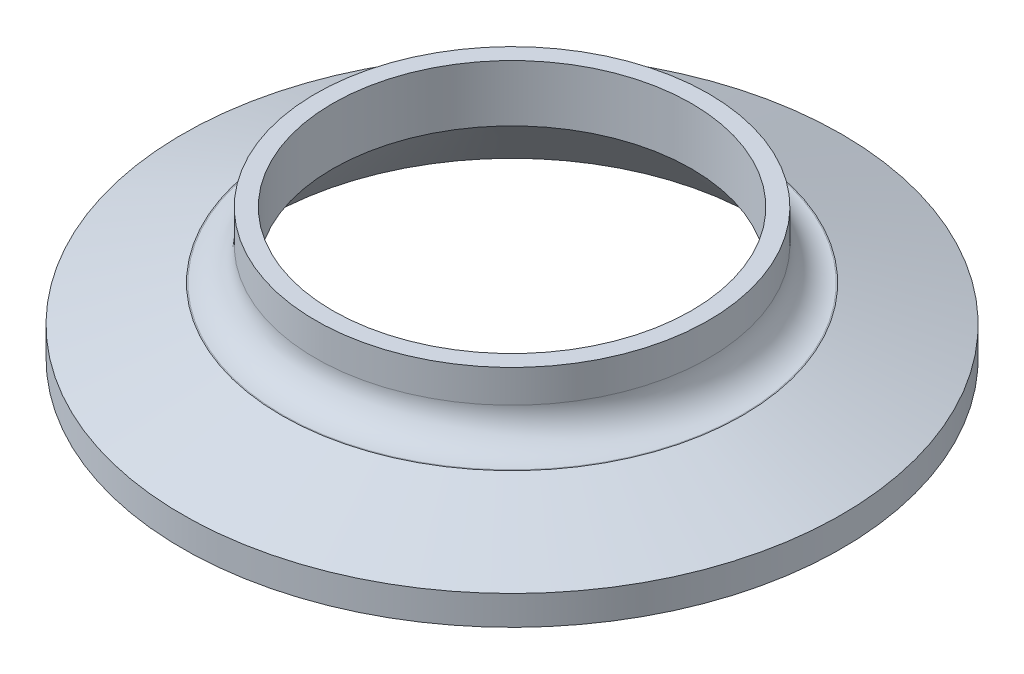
from build123d import *


with BuildPart() as part:
    # Sketch1 → Revolve1 (revolve)
    with BuildSketch(Plane.XY, mode=Mode.PRIVATE) as revolve1_sk:
        with BuildLine():
            Line((-19.05, 12.7), (-19.05, 9.525))
            ThreePointArc((-19.05, 9.525), (-19.97993597, 7.27993597), (-22.225, 6.35))
            Line((-22.225, 6.35), (-22.322742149, 6.35))
            Line((-22.322742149, 6.35), (-31.9532, 2.8448))
            Line((-31.9532, 2.8448), (-31.9532, 0))
            Line((-31.9532, 0), (-30.159172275, 0.002512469))
            ThreePointArc((-30.159172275, 0.002512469), (-29.724577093, 0.133310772), (-29.434366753, 0.482250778))
            Line((-29.434366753, 0.482250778), (-29.267498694, 0.87536729))
            ThreePointArc((-29.267498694, 0.87536729), (-28.1686, 1.602712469), (-27.069701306, 0.87536729))
            Line((-27.069701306, 0.87536729), (-26.902833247, 0.482250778))
            ThreePointArc((-26.902833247, 0.482250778), (-26.612622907, 0.133310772), (-26.178027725, 0.002512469))
            Line((-26.178027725, 0.002512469), (-23.749, 0))
            Line((-23.749, 0), (-17.399, 7.212805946))
            Line((-17.399, 7.212805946), (-17.399, 12.7))
            Line((-17.399, 12.7), (-19.05, 12.7))
        make_face()
    revolve(revolve1_sk.sketch.rotate(Axis((0, 0, 0), (0, 1, 0)), 270), axis=Axis((0, 0, 0), (0, 1, 0)))


solid = part.part
